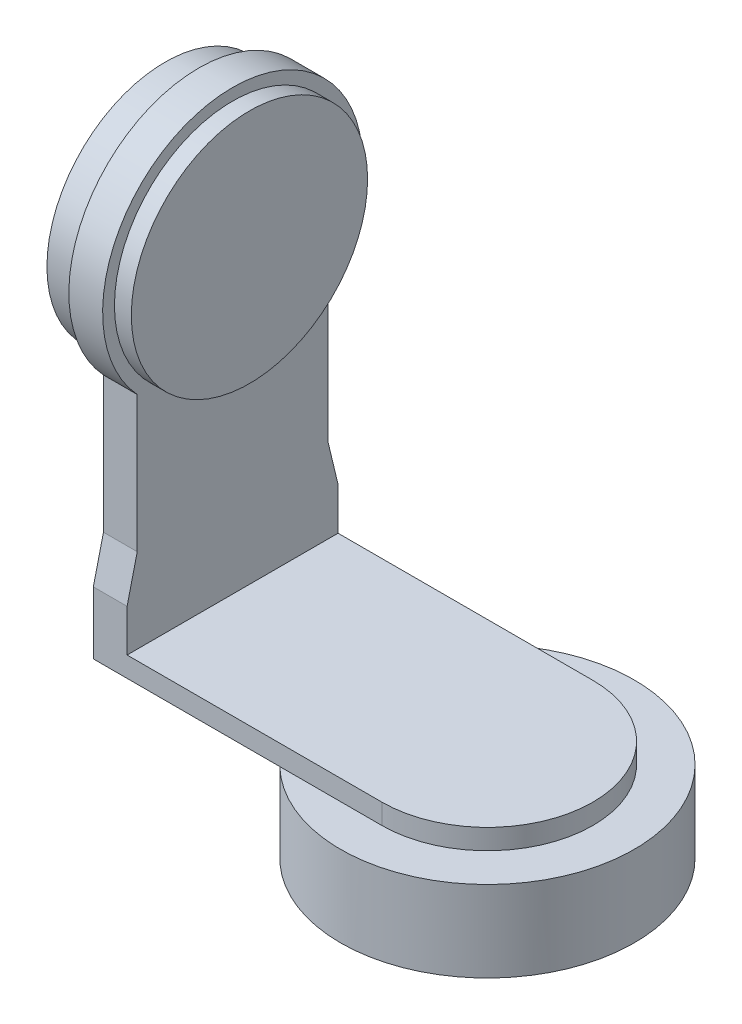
from build123d import *

# Parameters (mm, degrees)
SKETCH1_R           = 17.4
BOSS_EXTRUDE1_DEPTH = 9.6
BOSS_EXTRUDE2_DEPTH = 2.4
BOSS_EXTRUDE3_DEPTH = 4
SKETCH6_R           = 14
BOSS_EXTRUDE4_DEPTH = 4
BOSS_EXTRUDE5_START = 2
SKETCH7_R           = 14
BOSS_EXTRUDE5_DEPTH = 2


with BuildPart() as part:
    # Sketch1 → Boss-Extrude1 (new body)
    with BuildSketch(Plane(origin=(0, 0, 0), x_dir=(1, 0, 0), z_dir=(0, 1, 0))):
        with Locations(Location((0, 0, 0), (0, 0, 270))):
            Circle(SKETCH1_R)
    extrude(amount=BOSS_EXTRUDE1_DEPTH)

    # Sketch2 → Boss-Extrude2 (add)
    with BuildSketch(Plane(origin=(0, 9.6, 0), x_dir=(1, 0, 0), z_dir=(0, 1, 0))):
        with BuildLine():
            Line((0, -12.5), (-34.2, -12.5))
            Line((-34.2, -12.5), (-34.2, 12.5))
            Line((-34.2, 12.5), (0, 12.5))
            ThreePointArc((0, 12.5), (12.5, 0), (0, -12.5))
        make_face()
    extrude(amount=BOSS_EXTRUDE2_DEPTH)

    # Sketch5 → Boss-Extrude3 (add)
    with BuildSketch(Plane.ZY.offset(34.2)):
        with BuildLine():
            Line((11.3, 22), (11.3, 38.137208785))
            ThreePointArc((11.3, 38.137208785), (0, 64), (-11.3, 38.137208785))
            Line((-11.3, 38.137208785), (-11.3, 22))
            Line((-11.3, 22), (-12.5, 17))
            Line((-12.5, 17), (-12.5, 12))
            Line((-12.5, 12), (12.5, 12))
            Line((12.5, 12), (12.5, 17))
            Line((12.5, 17), (11.3, 22))
        make_face()
    extrude(amount=-BOSS_EXTRUDE3_DEPTH)

    # Sketch6 → Boss-Extrude4 (add)
    with BuildSketch(Plane.ZY.offset(34.2)):
        with Locations((0, 48.6)):
            Circle(SKETCH6_R)
    extrude(amount=BOSS_EXTRUDE4_DEPTH)

    # Sketch7 → Boss-Extrude5 (add)
    with BuildSketch(Plane(origin=(-30.2, 0, 0), x_dir=(0, 0, -1), z_dir=(1, 0, 0)).offset(BOSS_EXTRUDE5_START)):
        with Locations(Location((0, 48.6, 0), (0, 0, 180))):
            Circle(SKETCH7_R)
    extrude(amount=-BOSS_EXTRUDE5_DEPTH)


solid = part.part
